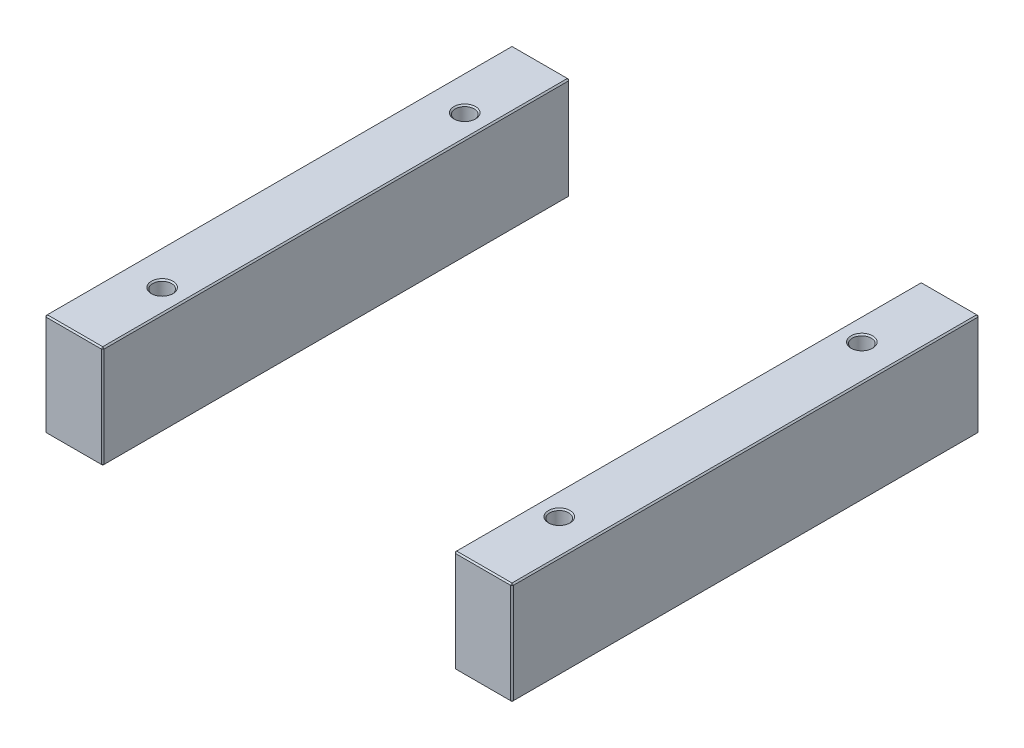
ISO-10303-21;
HEADER;
FILE_DESCRIPTION(('STEP AP214'),'2;1');
FILE_NAME('part.step','',(''),(''),'','','');
FILE_SCHEMA(('AUTOMOTIVE_DESIGN { 1 0 10303 214 1 1 1 1 }'));
ENDSEC;
DATA;
#1=APPLICATION_CONTEXT('core data for automotive mechanical design processes');
#2=APPLICATION_PROTOCOL_DEFINITION('international standard','automotive_design',2000,#1);
#3=PRODUCT_CONTEXT('',#1,'mechanical');
#4=PRODUCT('Part','Part','',(#3));
#5=PRODUCT_RELATED_PRODUCT_CATEGORY('part','',(#4));
#6=PRODUCT_DEFINITION_FORMATION('','',#4);
#7=PRODUCT_DEFINITION_CONTEXT('part definition',#1,'design');
#8=PRODUCT_DEFINITION('design','',#6,#7);
#9=PRODUCT_DEFINITION_SHAPE('','',#8);
#10=(LENGTH_UNIT() NAMED_UNIT(*) SI_UNIT(.MILLI.,.METRE.));
#11=(NAMED_UNIT(*) PLANE_ANGLE_UNIT() SI_UNIT($,.RADIAN.));
#12=(NAMED_UNIT(*) SI_UNIT($,.STERADIAN.) SOLID_ANGLE_UNIT());
#13=UNCERTAINTY_MEASURE_WITH_UNIT(LENGTH_MEASURE(1.E-05),#10,'distance_accuracy_value','');
#14=(GEOMETRIC_REPRESENTATION_CONTEXT(3) GLOBAL_UNCERTAINTY_ASSIGNED_CONTEXT((#13)) GLOBAL_UNIT_ASSIGNED_CONTEXT((#10,
#11,#12)) REPRESENTATION_CONTEXT('',''));
#15=CARTESIAN_POINT('',(0.,0.,0.));
#16=DIRECTION('',(0.,0.,1.));
#17=DIRECTION('',(1.,0.,0.));
#18=AXIS2_PLACEMENT_3D('',#15,#16,#17);
#19=CARTESIAN_POINT('',(-173.,76.,-173.));
#20=DIRECTION('',(0.,0.,1.));
#21=DIRECTION('',(1.,0.,0.));
#22=AXIS2_PLACEMENT_3D('',#19,#20,#21);
#23=PLANE('',#22);
#24=DIRECTION('',(-1.,0.,0.));
#25=VECTOR('',#24,1.);
#26=CARTESIAN_POINT('',(-173.,1.00000000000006,-173.));
#27=LINE('',#26,#25);
#28=CARTESIAN_POINT('',(-131.,1.00000000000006,-173.));
#29=VERTEX_POINT('',#28);
#30=CARTESIAN_POINT('',(-172.,1.00000000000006,-173.));
#31=VERTEX_POINT('',#30);
#32=EDGE_CURVE('P0_E137',#29,#31,#27,.T.);
#33=ORIENTED_EDGE('',*,*,#32,.T.);
#34=DIRECTION('',(0.,1.,0.));
#35=VECTOR('',#34,1.);
#36=CARTESIAN_POINT('',(-172.,76.,-173.));
#37=LINE('',#36,#35);
#38=CARTESIAN_POINT('',(-172.,75.,-173.));
#39=VERTEX_POINT('',#38);
#40=EDGE_CURVE('P0_E235',#31,#39,#37,.T.);
#41=ORIENTED_EDGE('',*,*,#40,.T.);
#42=DIRECTION('',(1.,0.,0.));
#43=VECTOR('',#42,1.);
#44=CARTESIAN_POINT('',(-173.,75.,-173.));
#45=LINE('',#44,#43);
#46=CARTESIAN_POINT('',(-131.,75.,-173.));
#47=VERTEX_POINT('',#46);
#48=EDGE_CURVE('P0_E233',#39,#47,#45,.T.);
#49=ORIENTED_EDGE('',*,*,#48,.T.);
#50=DIRECTION('',(0.,-1.,0.));
#51=VECTOR('',#50,1.);
#52=CARTESIAN_POINT('',(-131.,76.,-173.));
#53=LINE('',#52,#51);
#54=EDGE_CURVE('P0_E230',#47,#29,#53,.T.);
#55=ORIENTED_EDGE('',*,*,#54,.T.);
#56=EDGE_LOOP('',(#33,#41,#49,#55));
#57=FACE_BOUND('',#56,.T.);
#58=ADVANCED_FACE('P0_F16',(#57),#23,.F.);
#59=CARTESIAN_POINT('',(-173.,76.,173.));
#60=DIRECTION('',(1.,0.,0.));
#61=DIRECTION('',(0.,0.,-1.));
#62=AXIS2_PLACEMENT_3D('',#59,#60,#61);
#63=PLANE('',#62);
#64=DIRECTION('',(0.,1.,0.));
#65=VECTOR('',#64,1.);
#66=CARTESIAN_POINT('',(-173.,76.,172.));
#67=LINE('',#66,#65);
#68=CARTESIAN_POINT('',(-173.,1.00000000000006,172.));
#69=VERTEX_POINT('',#68);
#70=CARTESIAN_POINT('',(-173.,75.,172.));
#71=VERTEX_POINT('',#70);
#72=EDGE_CURVE('P0_E217',#69,#71,#67,.T.);
#73=ORIENTED_EDGE('',*,*,#72,.T.);
#74=DIRECTION('',(0.,0.,-1.));
#75=VECTOR('',#74,1.);
#76=CARTESIAN_POINT('',(-173.,75.,173.));
#77=LINE('',#76,#75);
#78=CARTESIAN_POINT('',(-173.,75.,-172.));
#79=VERTEX_POINT('',#78);
#80=EDGE_CURVE('P0_E228',#71,#79,#77,.T.);
#81=ORIENTED_EDGE('',*,*,#80,.T.);
#82=DIRECTION('',(0.,-1.,0.));
#83=VECTOR('',#82,1.);
#84=CARTESIAN_POINT('',(-173.,76.,-172.));
#85=LINE('',#84,#83);
#86=CARTESIAN_POINT('',(-173.,1.00000000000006,-172.));
#87=VERTEX_POINT('',#86);
#88=EDGE_CURVE('P0_E225',#79,#87,#85,.T.);
#89=ORIENTED_EDGE('',*,*,#88,.T.);
#90=DIRECTION('',(0.,0.,1.));
#91=VECTOR('',#90,1.);
#92=CARTESIAN_POINT('',(-173.,1.00000000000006,173.));
#93=LINE('',#92,#91);
#94=EDGE_CURVE('P0_E214',#87,#69,#93,.T.);
#95=ORIENTED_EDGE('',*,*,#94,.T.);
#96=EDGE_LOOP('',(#73,#81,#89,#95));
#97=FACE_BOUND('',#96,.T.);
#98=ADVANCED_FACE('P0_F302',(#97),#63,.F.);
#99=CARTESIAN_POINT('',(-173.,76.,173.));
#100=DIRECTION('',(0.,0.,-1.));
#101=DIRECTION('',(-1.,0.,0.));
#102=AXIS2_PLACEMENT_3D('',#99,#100,#101);
#103=PLANE('',#102);
#104=DIRECTION('',(-1.,0.,0.));
#105=VECTOR('',#104,1.);
#106=CARTESIAN_POINT('',(-173.,75.,173.));
#107=LINE('',#106,#105);
#108=CARTESIAN_POINT('',(-131.,75.,173.));
#109=VERTEX_POINT('',#108);
#110=CARTESIAN_POINT('',(-172.,75.,173.));
#111=VERTEX_POINT('',#110);
#112=EDGE_CURVE('P0_E242',#109,#111,#107,.T.);
#113=ORIENTED_EDGE('',*,*,#112,.T.);
#114=DIRECTION('',(0.,-1.,0.));
#115=VECTOR('',#114,1.);
#116=CARTESIAN_POINT('',(-172.,76.,173.));
#117=LINE('',#116,#115);
#118=CARTESIAN_POINT('',(-172.,1.00000000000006,173.));
#119=VERTEX_POINT('',#118);
#120=EDGE_CURVE('P0_E244',#111,#119,#117,.T.);
#121=ORIENTED_EDGE('',*,*,#120,.T.);
#122=DIRECTION('',(1.,0.,0.));
#123=VECTOR('',#122,1.);
#124=CARTESIAN_POINT('',(-130.,1.00000000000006,173.));
#125=LINE('',#124,#123);
#126=CARTESIAN_POINT('',(-131.,1.00000000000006,173.));
#127=VERTEX_POINT('',#126);
#128=EDGE_CURVE('P0_E240',#119,#127,#125,.T.);
#129=ORIENTED_EDGE('',*,*,#128,.T.);
#130=DIRECTION('',(0.,1.,0.));
#131=VECTOR('',#130,1.);
#132=CARTESIAN_POINT('',(-131.,76.,173.));
#133=LINE('',#132,#131);
#134=EDGE_CURVE('P0_E238',#127,#109,#133,.T.);
#135=ORIENTED_EDGE('',*,*,#134,.T.);
#136=EDGE_LOOP('',(#113,#121,#129,#135));
#137=FACE_BOUND('',#136,.T.);
#138=ADVANCED_FACE('P0_F341',(#137),#103,.F.);
#139=CARTESIAN_POINT('',(-130.,76.,-173.));
#140=DIRECTION('',(-1.,0.,0.));
#141=DIRECTION('',(0.,0.,1.));
#142=AXIS2_PLACEMENT_3D('',#139,#140,#141);
#143=PLANE('',#142);
#144=DIRECTION('',(0.,0.,1.));
#145=VECTOR('',#144,1.);
#146=CARTESIAN_POINT('',(-130.,75.,-173.));
#147=LINE('',#146,#145);
#148=CARTESIAN_POINT('',(-130.,75.,-172.));
#149=VERTEX_POINT('',#148);
#150=CARTESIAN_POINT('',(-130.,75.,172.));
#151=VERTEX_POINT('',#150);
#152=EDGE_CURVE('P0_E31',#149,#151,#147,.T.);
#153=ORIENTED_EDGE('',*,*,#152,.T.);
#154=DIRECTION('',(0.,-1.,0.));
#155=VECTOR('',#154,1.);
#156=CARTESIAN_POINT('',(-130.,76.,172.));
#157=LINE('',#156,#155);
#158=CARTESIAN_POINT('',(-130.,1.00000000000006,172.));
#159=VERTEX_POINT('',#158);
#160=EDGE_CURVE('P0_E190',#151,#159,#157,.T.);
#161=ORIENTED_EDGE('',*,*,#160,.T.);
#162=DIRECTION('',(0.,0.,-1.));
#163=VECTOR('',#162,1.);
#164=CARTESIAN_POINT('',(-130.,1.00000000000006,-173.));
#165=LINE('',#164,#163);
#166=CARTESIAN_POINT('',(-130.,1.00000000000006,-172.));
#167=VERTEX_POINT('',#166);
#168=EDGE_CURVE('P0_E256',#159,#167,#165,.T.);
#169=ORIENTED_EDGE('',*,*,#168,.T.);
#170=DIRECTION('',(0.,1.,0.));
#171=VECTOR('',#170,1.);
#172=CARTESIAN_POINT('',(-130.,76.,-172.));
#173=LINE('',#172,#171);
#174=EDGE_CURVE('P0_E36',#167,#149,#173,.T.);
#175=ORIENTED_EDGE('',*,*,#174,.T.);
#176=EDGE_LOOP('',(#153,#161,#169,#175));
#177=FACE_BOUND('',#176,.T.);
#178=ADVANCED_FACE('P0_F535',(#177),#143,.F.);
#179=CARTESIAN_POINT('',(0.,76.,0.));
#180=DIRECTION('',(0.,-1.,0.));
#181=DIRECTION('',(0.,0.,-1.));
#182=AXIS2_PLACEMENT_3D('',#179,#180,#181);
#183=PLANE('',#182);
#184=CARTESIAN_POINT('',(-147.,76.,112.));
#185=DIRECTION('',(0.,-1.,0.));
#186=DIRECTION('',(0.,0.,-1.));
#187=AXIS2_PLACEMENT_3D('',#184,#185,#186);
#188=CIRCLE('',#187,8.);
#189=CARTESIAN_POINT('',(-147.,76.,104.));
#190=VERTEX_POINT('',#189);
#191=EDGE_CURVE('P0_E24',#190,#190,#188,.T.);
#192=ORIENTED_EDGE('',*,*,#191,.T.);
#193=EDGE_LOOP('',(#192));
#194=FACE_BOUND('',#193,.T.);
#195=CARTESIAN_POINT('',(-147.,76.,-112.));
#196=DIRECTION('',(0.,-1.,0.));
#197=DIRECTION('',(0.,0.,-1.));
#198=AXIS2_PLACEMENT_3D('',#195,#196,#197);
#199=CIRCLE('',#198,8.);
#200=CARTESIAN_POINT('',(-147.,76.,-120.));
#201=VERTEX_POINT('',#200);
#202=EDGE_CURVE('P0_E189',#201,#201,#199,.T.);
#203=ORIENTED_EDGE('',*,*,#202,.T.);
#204=EDGE_LOOP('',(#203));
#205=FACE_BOUND('',#204,.T.);
#206=DIRECTION('',(0.,0.,1.));
#207=VECTOR('',#206,1.);
#208=CARTESIAN_POINT('',(-172.,76.,0.));
#209=LINE('',#208,#207);
#210=CARTESIAN_POINT('',(-172.,76.,-172.));
#211=VERTEX_POINT('',#210);
#212=CARTESIAN_POINT('',(-172.,76.,172.));
#213=VERTEX_POINT('',#212);
#214=EDGE_CURVE('P0_E251',#211,#213,#209,.T.);
#215=ORIENTED_EDGE('',*,*,#214,.T.);
#216=DIRECTION('',(1.,0.,0.));
#217=VECTOR('',#216,1.);
#218=CARTESIAN_POINT('',(1.11022302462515E-13,76.,172.));
#219=LINE('',#218,#217);
#220=CARTESIAN_POINT('',(-131.,76.,172.));
#221=VERTEX_POINT('',#220);
#222=EDGE_CURVE('P0_E253',#213,#221,#219,.T.);
#223=ORIENTED_EDGE('',*,*,#222,.T.);
#224=DIRECTION('',(0.,0.,-1.));
#225=VECTOR('',#224,1.);
#226=CARTESIAN_POINT('',(-131.,76.,0.));
#227=LINE('',#226,#225);
#228=CARTESIAN_POINT('',(-131.,76.,-172.));
#229=VERTEX_POINT('',#228);
#230=EDGE_CURVE('P0_E247',#221,#229,#227,.T.);
#231=ORIENTED_EDGE('',*,*,#230,.T.);
#232=DIRECTION('',(-1.,0.,0.));
#233=VECTOR('',#232,1.);
#234=CARTESIAN_POINT('',(-1.11022302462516E-13,76.,-172.));
#235=LINE('',#234,#233);
#236=EDGE_CURVE('P0_E249',#229,#211,#235,.T.);
#237=ORIENTED_EDGE('',*,*,#236,.T.);
#238=EDGE_LOOP('',(#215,#223,#231,#237));
#239=FACE_BOUND('',#238,.T.);
#240=ADVANCED_FACE('P0_F195',(#194,#205,#239),#183,.F.);
#241=CARTESIAN_POINT('',(0.,0.,0.));
#242=DIRECTION('',(0.,-1.,0.));
#243=DIRECTION('',(0.,0.,-1.));
#244=AXIS2_PLACEMENT_3D('',#241,#242,#243);
#245=PLANE('',#244);
#246=CARTESIAN_POINT('',(-147.,0.,-112.));
#247=DIRECTION('',(0.,-1.,0.));
#248=DIRECTION('',(0.,0.,-1.));
#249=AXIS2_PLACEMENT_3D('',#246,#247,#248);
#250=CIRCLE('',#249,8.);
#251=CARTESIAN_POINT('',(-147.,0.,-120.));
#252=VERTEX_POINT('',#251);
#253=EDGE_CURVE('P0_E220',#252,#252,#250,.F.);
#254=ORIENTED_EDGE('',*,*,#253,.T.);
#255=EDGE_LOOP('',(#254));
#256=FACE_BOUND('',#255,.T.);
#257=CARTESIAN_POINT('',(-147.,0.,112.));
#258=DIRECTION('',(0.,-1.,0.));
#259=DIRECTION('',(0.,0.,-1.));
#260=AXIS2_PLACEMENT_3D('',#257,#258,#259);
#261=CIRCLE('',#260,8.);
#262=CARTESIAN_POINT('',(-147.,0.,104.));
#263=VERTEX_POINT('',#262);
#264=EDGE_CURVE('P0_E608',#263,#263,#261,.F.);
#265=ORIENTED_EDGE('',*,*,#264,.T.);
#266=EDGE_LOOP('',(#265));
#267=FACE_BOUND('',#266,.T.);
#268=DIRECTION('',(-1.,0.,0.));
#269=VECTOR('',#268,1.);
#270=CARTESIAN_POINT('',(-173.,0.,172.));
#271=LINE('',#270,#269);
#272=CARTESIAN_POINT('',(-131.,0.,172.));
#273=VERTEX_POINT('',#272);
#274=CARTESIAN_POINT('',(-172.,0.,172.));
#275=VERTEX_POINT('',#274);
#276=EDGE_CURVE('P0_E114',#273,#275,#271,.T.);
#277=ORIENTED_EDGE('',*,*,#276,.T.);
#278=DIRECTION('',(0.,0.,-1.));
#279=VECTOR('',#278,1.);
#280=CARTESIAN_POINT('',(-172.,0.,-173.));
#281=LINE('',#280,#279);
#282=CARTESIAN_POINT('',(-172.,0.,-172.));
#283=VERTEX_POINT('',#282);
#284=EDGE_CURVE('P0_E110',#275,#283,#281,.T.);
#285=ORIENTED_EDGE('',*,*,#284,.T.);
#286=DIRECTION('',(1.,0.,0.));
#287=VECTOR('',#286,1.);
#288=CARTESIAN_POINT('',(-130.,0.,-172.));
#289=LINE('',#288,#287);
#290=CARTESIAN_POINT('',(-131.,0.,-172.));
#291=VERTEX_POINT('',#290);
#292=EDGE_CURVE('P0_E104',#283,#291,#289,.T.);
#293=ORIENTED_EDGE('',*,*,#292,.T.);
#294=DIRECTION('',(0.,0.,1.));
#295=VECTOR('',#294,1.);
#296=CARTESIAN_POINT('',(-131.,0.,173.));
#297=LINE('',#296,#295);
#298=EDGE_CURVE('P0_E107',#291,#273,#297,.T.);
#299=ORIENTED_EDGE('',*,*,#298,.T.);
#300=EDGE_LOOP('',(#277,#285,#293,#299));
#301=FACE_BOUND('',#300,.T.);
#302=ADVANCED_FACE('P0_F106',(#256,#267,#301),#245,.T.);
#303=CARTESIAN_POINT('',(-147.,0.,-112.));
#304=DIRECTION('',(0.,1.,0.));
#305=DIRECTION('',(0.,0.,1.));
#306=AXIS2_PLACEMENT_3D('',#303,#304,#305);
#307=CYLINDRICAL_SURFACE('',#306,7.);
#308=CARTESIAN_POINT('',(-147.,75.,-112.));
#309=DIRECTION('',(0.,-1.,0.));
#310=DIRECTION('',(0.,0.,-1.));
#311=AXIS2_PLACEMENT_3D('',#308,#309,#310);
#312=CIRCLE('',#311,7.);
#313=CARTESIAN_POINT('',(-147.,75.,-119.));
#314=VERTEX_POINT('',#313);
#315=EDGE_CURVE('P0_E10',#314,#314,#312,.F.);
#316=ORIENTED_EDGE('',*,*,#315,.T.);
#317=EDGE_LOOP('',(#316));
#318=FACE_BOUND('',#317,.T.);
#319=CARTESIAN_POINT('',(-147.,0.99999999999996,-112.));
#320=DIRECTION('',(0.,-1.,0.));
#321=DIRECTION('',(0.,0.,-1.));
#322=AXIS2_PLACEMENT_3D('',#319,#320,#321);
#323=CIRCLE('',#322,7.);
#324=CARTESIAN_POINT('',(-147.,0.99999999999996,-119.));
#325=VERTEX_POINT('',#324);
#326=EDGE_CURVE('P0_E215',#325,#325,#323,.T.);
#327=ORIENTED_EDGE('',*,*,#326,.T.);
#328=EDGE_LOOP('',(#327));
#329=FACE_BOUND('',#328,.T.);
#330=ADVANCED_FACE('P0_F208',(#318,#329),#307,.F.);
#331=CARTESIAN_POINT('',(-147.,0.,112.));
#332=DIRECTION('',(0.,1.,0.));
#333=DIRECTION('',(0.,0.,1.));
#334=AXIS2_PLACEMENT_3D('',#331,#332,#333);
#335=CYLINDRICAL_SURFACE('',#334,7.);
#336=CARTESIAN_POINT('',(-147.,75.,112.));
#337=DIRECTION('',(0.,-1.,0.));
#338=DIRECTION('',(0.,0.,-1.));
#339=AXIS2_PLACEMENT_3D('',#336,#337,#338);
#340=CIRCLE('',#339,7.);
#341=CARTESIAN_POINT('',(-147.,75.,105.));
#342=VERTEX_POINT('',#341);
#343=EDGE_CURVE('P0_E186',#342,#342,#340,.F.);
#344=ORIENTED_EDGE('',*,*,#343,.T.);
#345=EDGE_LOOP('',(#344));
#346=FACE_BOUND('',#345,.T.);
#347=CARTESIAN_POINT('',(-147.,0.99999999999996,112.));
#348=DIRECTION('',(0.,-1.,0.));
#349=DIRECTION('',(0.,0.,-1.));
#350=AXIS2_PLACEMENT_3D('',#347,#348,#349);
#351=CIRCLE('',#350,7.);
#352=CARTESIAN_POINT('',(-147.,0.99999999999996,105.));
#353=VERTEX_POINT('',#352);
#354=EDGE_CURVE('P0_E212',#353,#353,#351,.T.);
#355=ORIENTED_EDGE('',*,*,#354,.T.);
#356=EDGE_LOOP('',(#355));
#357=FACE_BOUND('',#356,.T.);
#358=ADVANCED_FACE('P0_F204',(#346,#357),#335,.F.);
#359=CARTESIAN_POINT('',(-147.,0.,-112.));
#360=DIRECTION('',(0.,-1.,0.));
#361=DIRECTION('',(0.,0.,-1.));
#362=AXIS2_PLACEMENT_3D('',#359,#360,#361);
#363=CONICAL_SURFACE('',#362,8.,0.78539816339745);
#364=ORIENTED_EDGE('',*,*,#326,.F.);
#365=EDGE_LOOP('',(#364));
#366=FACE_BOUND('',#365,.T.);
#367=ORIENTED_EDGE('',*,*,#253,.F.);
#368=EDGE_LOOP('',(#367));
#369=FACE_BOUND('',#368,.T.);
#370=ADVANCED_FACE('P0_F207',(#366,#369),#363,.F.);
#371=CARTESIAN_POINT('',(-147.,0.,112.));
#372=DIRECTION('',(0.,-1.,0.));
#373=DIRECTION('',(0.,0.,-1.));
#374=AXIS2_PLACEMENT_3D('',#371,#372,#373);
#375=CONICAL_SURFACE('',#374,8.,0.78539816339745);
#376=ORIENTED_EDGE('',*,*,#354,.F.);
#377=EDGE_LOOP('',(#376));
#378=FACE_BOUND('',#377,.T.);
#379=ORIENTED_EDGE('',*,*,#264,.F.);
#380=EDGE_LOOP('',(#379));
#381=FACE_BOUND('',#380,.T.);
#382=ADVANCED_FACE('P0_F347',(#378,#381),#375,.F.);
#383=CARTESIAN_POINT('',(-130.,76.,172.));
#384=DIRECTION('',(-0.707106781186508,0.,-0.707106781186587));
#385=DIRECTION('',(0.,-1.,0.));
#386=AXIS2_PLACEMENT_3D('',#383,#384,#385);
#387=PLANE('',#386);
#388=DIRECTION('',(-0.707106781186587,0.,0.707106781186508));
#389=VECTOR('',#388,1.);
#390=CARTESIAN_POINT('',(-130.5,75.,172.5));
#391=LINE('',#390,#389);
#392=EDGE_CURVE('P0_E125',#109,#151,#391,.F.);
#393=ORIENTED_EDGE('',*,*,#392,.F.);
#394=ORIENTED_EDGE('',*,*,#134,.F.);
#395=DIRECTION('',(0.707106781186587,0.,-0.707106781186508));
#396=VECTOR('',#395,1.);
#397=CARTESIAN_POINT('',(-131.,1.00000000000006,173.));
#398=LINE('',#397,#396);
#399=EDGE_CURVE('P0_E181',#159,#127,#398,.F.);
#400=ORIENTED_EDGE('',*,*,#399,.F.);
#401=ORIENTED_EDGE('',*,*,#160,.F.);
#402=EDGE_LOOP('',(#393,#394,#400,#401));
#403=FACE_BOUND('',#402,.T.);
#404=ADVANCED_FACE('P0_F351',(#403),#387,.F.);
#405=CARTESIAN_POINT('',(-131.,76.,172.));
#406=DIRECTION('',(0.577350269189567,0.577350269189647,0.577350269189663));
#407=DIRECTION('',(0.,-0.707106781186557,0.707106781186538));
#408=AXIS2_PLACEMENT_3D('',#405,#406,#407);
#409=PLANE('',#408);
#410=DIRECTION('',(0.,0.707106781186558,-0.707106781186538));
#411=VECTOR('',#410,1.);
#412=CARTESIAN_POINT('',(-131.,76.,172.));
#413=LINE('',#412,#411);
#414=EDGE_CURVE('P0_E175',#109,#221,#413,.T.);
#415=ORIENTED_EDGE('',*,*,#414,.F.);
#416=ORIENTED_EDGE('',*,*,#392,.T.);
#417=DIRECTION('',(0.707106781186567,-0.707106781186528,0.));
#418=VECTOR('',#417,1.);
#419=CARTESIAN_POINT('',(-131.,76.,172.));
#420=LINE('',#419,#418);
#421=EDGE_CURVE('P0_E178',#221,#151,#420,.T.);
#422=ORIENTED_EDGE('',*,*,#421,.F.);
#423=EDGE_LOOP('',(#415,#416,#422));
#424=FACE_BOUND('',#423,.T.);
#425=ADVANCED_FACE('P0_F487',(#424),#409,.T.);
#426=CARTESIAN_POINT('',(-131.,1.00000000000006,173.));
#427=DIRECTION('',(0.577350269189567,-0.577350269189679,0.577350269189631));
#428=DIRECTION('',(0.,-0.707106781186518,-0.707106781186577));
#429=AXIS2_PLACEMENT_3D('',#426,#427,#428);
#430=PLANE('',#429);
#431=DIRECTION('',(0.707106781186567,0.707106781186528,0.));
#432=VECTOR('',#431,1.);
#433=CARTESIAN_POINT('',(-130.5,0.50000000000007,172.));
#434=LINE('',#433,#432);
#435=EDGE_CURVE('P0_E123',#159,#273,#434,.F.);
#436=ORIENTED_EDGE('',*,*,#435,.F.);
#437=ORIENTED_EDGE('',*,*,#399,.T.);
#438=DIRECTION('',(0.,-0.707106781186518,-0.707106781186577));
#439=VECTOR('',#438,1.);
#440=CARTESIAN_POINT('',(-131.,1.00000000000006,173.));
#441=LINE('',#440,#439);
#442=EDGE_CURVE('P0_E172',#273,#127,#441,.F.);
#443=ORIENTED_EDGE('',*,*,#442,.F.);
#444=EDGE_LOOP('',(#436,#437,#443));
#445=FACE_BOUND('',#444,.T.);
#446=ADVANCED_FACE('P0_F478',(#445),#430,.T.);
#447=CARTESIAN_POINT('',(-131.,76.,0.));
#448=DIRECTION('',(-0.707106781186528,-0.707106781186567,0.));
#449=DIRECTION('',(0.,0.,-1.));
#450=AXIS2_PLACEMENT_3D('',#447,#448,#449);
#451=PLANE('',#450);
#452=ORIENTED_EDGE('',*,*,#421,.T.);
#453=ORIENTED_EDGE('',*,*,#152,.F.);
#454=DIRECTION('',(-0.707106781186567,0.707106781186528,0.));
#455=VECTOR('',#454,1.);
#456=CARTESIAN_POINT('',(-130.5,75.5,-172.));
#457=LINE('',#456,#455);
#458=EDGE_CURVE('P0_E165',#229,#149,#457,.F.);
#459=ORIENTED_EDGE('',*,*,#458,.F.);
#460=ORIENTED_EDGE('',*,*,#230,.F.);
#461=EDGE_LOOP('',(#452,#453,#459,#460));
#462=FACE_BOUND('',#461,.T.);
#463=ADVANCED_FACE('P0_F318',(#462),#451,.F.);
#464=CARTESIAN_POINT('',(1.11022302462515E-13,76.,172.));
#465=DIRECTION('',(0.,-0.707106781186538,-0.707106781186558));
#466=DIRECTION('',(1.,0.,0.));
#467=AXIS2_PLACEMENT_3D('',#464,#465,#466);
#468=PLANE('',#467);
#469=ORIENTED_EDGE('',*,*,#414,.T.);
#470=ORIENTED_EDGE('',*,*,#222,.F.);
#471=DIRECTION('',(0.,-0.707106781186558,0.707106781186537));
#472=VECTOR('',#471,1.);
#473=CARTESIAN_POINT('',(-172.,75.5,172.5));
#474=LINE('',#473,#472);
#475=EDGE_CURVE('P0_E162',#111,#213,#474,.F.);
#476=ORIENTED_EDGE('',*,*,#475,.F.);
#477=ORIENTED_EDGE('',*,*,#112,.F.);
#478=EDGE_LOOP('',(#469,#470,#476,#477));
#479=FACE_BOUND('',#478,.T.);
#480=ADVANCED_FACE('P0_F313',(#479),#468,.F.);
#481=CARTESIAN_POINT('',(-172.,76.,173.));
#482=DIRECTION('',(0.707106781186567,0.,-0.707106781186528));
#483=DIRECTION('',(0.,-1.,0.));
#484=AXIS2_PLACEMENT_3D('',#481,#482,#483);
#485=PLANE('',#484);
#486=DIRECTION('',(0.707106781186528,0.,0.707106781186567));
#487=VECTOR('',#486,1.);
#488=CARTESIAN_POINT('',(-172.,1.00000000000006,173.));
#489=LINE('',#488,#487);
#490=EDGE_CURVE('P0_E156',#119,#69,#489,.F.);
#491=ORIENTED_EDGE('',*,*,#490,.F.);
#492=ORIENTED_EDGE('',*,*,#120,.F.);
#493=DIRECTION('',(-0.707106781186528,0.,-0.707106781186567));
#494=VECTOR('',#493,1.);
#495=CARTESIAN_POINT('',(-173.,75.,172.));
#496=LINE('',#495,#494);
#497=EDGE_CURVE('P0_E159',#71,#111,#496,.F.);
#498=ORIENTED_EDGE('',*,*,#497,.F.);
#499=ORIENTED_EDGE('',*,*,#72,.F.);
#500=EDGE_LOOP('',(#491,#492,#498,#499));
#501=FACE_BOUND('',#500,.T.);
#502=ADVANCED_FACE('P0_F307',(#501),#485,.F.);
#503=CARTESIAN_POINT('',(-173.,1.00000000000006,173.));
#504=DIRECTION('',(0.,-0.707106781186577,0.707106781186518));
#505=DIRECTION('',(-1.,0.,0.));
#506=AXIS2_PLACEMENT_3D('',#503,#504,#505);
#507=PLANE('',#506);
#508=ORIENTED_EDGE('',*,*,#442,.T.);
#509=ORIENTED_EDGE('',*,*,#128,.F.);
#510=DIRECTION('',(0.,0.707106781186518,0.707106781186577));
#511=VECTOR('',#510,1.);
#512=CARTESIAN_POINT('',(-172.,1.00000000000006,173.));
#513=LINE('',#512,#511);
#514=EDGE_CURVE('P0_E134',#275,#119,#513,.T.);
#515=ORIENTED_EDGE('',*,*,#514,.F.);
#516=ORIENTED_EDGE('',*,*,#276,.F.);
#517=EDGE_LOOP('',(#508,#509,#515,#516));
#518=FACE_BOUND('',#517,.T.);
#519=ADVANCED_FACE('P0_F333',(#518),#507,.T.);
#520=CARTESIAN_POINT('',(-130.,1.00000000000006,-173.));
#521=DIRECTION('',(0.707106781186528,-0.707106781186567,0.));
#522=DIRECTION('',(0.,0.,1.));
#523=AXIS2_PLACEMENT_3D('',#520,#521,#522);
#524=PLANE('',#523);
#525=ORIENTED_EDGE('',*,*,#435,.T.);
#526=ORIENTED_EDGE('',*,*,#298,.F.);
#527=DIRECTION('',(-0.707106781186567,-0.707106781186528,0.));
#528=VECTOR('',#527,1.);
#529=CARTESIAN_POINT('',(-131.,0.,-172.));
#530=LINE('',#529,#528);
#531=EDGE_CURVE('P0_E120',#167,#291,#530,.T.);
#532=ORIENTED_EDGE('',*,*,#531,.F.);
#533=ORIENTED_EDGE('',*,*,#168,.F.);
#534=EDGE_LOOP('',(#525,#526,#532,#533));
#535=FACE_BOUND('',#534,.T.);
#536=ADVANCED_FACE('P0_F119',(#535),#524,.T.);
#537=CARTESIAN_POINT('',(-131.,76.,-173.));
#538=DIRECTION('',(-0.707106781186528,0.,0.707106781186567));
#539=DIRECTION('',(0.,-1.,0.));
#540=AXIS2_PLACEMENT_3D('',#537,#538,#539);
#541=PLANE('',#540);
#542=DIRECTION('',(0.707106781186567,0.,0.707106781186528));
#543=VECTOR('',#542,1.);
#544=CARTESIAN_POINT('',(-131.,75.,-173.));
#545=LINE('',#544,#543);
#546=EDGE_CURVE('P0_E168',#149,#47,#545,.F.);
#547=ORIENTED_EDGE('',*,*,#546,.F.);
#548=ORIENTED_EDGE('',*,*,#174,.F.);
#549=DIRECTION('',(-0.707106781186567,0.,-0.707106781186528));
#550=VECTOR('',#549,1.);
#551=CARTESIAN_POINT('',(-130.5,1.00000000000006,-172.5));
#552=LINE('',#551,#550);
#553=EDGE_CURVE('P0_E133',#29,#167,#552,.F.);
#554=ORIENTED_EDGE('',*,*,#553,.F.);
#555=ORIENTED_EDGE('',*,*,#54,.F.);
#556=EDGE_LOOP('',(#547,#548,#554,#555));
#557=FACE_BOUND('',#556,.T.);
#558=ADVANCED_FACE('P0_F323',(#557),#541,.F.);
#559=CARTESIAN_POINT('',(-131.,75.,-173.));
#560=DIRECTION('',(0.577350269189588,0.577350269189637,-0.577350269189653));
#561=DIRECTION('',(0.,0.707106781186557,0.707106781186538));
#562=AXIS2_PLACEMENT_3D('',#559,#560,#561);
#563=PLANE('',#562);
#564=ORIENTED_EDGE('',*,*,#458,.T.);
#565=ORIENTED_EDGE('',*,*,#546,.T.);
#566=DIRECTION('',(0.,-0.707106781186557,-0.707106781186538));
#567=VECTOR('',#566,1.);
#568=CARTESIAN_POINT('',(-131.,75.,-173.));
#569=LINE('',#568,#567);
#570=EDGE_CURVE('P0_E151',#229,#47,#569,.T.);
#571=ORIENTED_EDGE('',*,*,#570,.F.);
#572=EDGE_LOOP('',(#564,#565,#571));
#573=FACE_BOUND('',#572,.T.);
#574=ADVANCED_FACE('P0_F321',(#573),#563,.T.);
#575=CARTESIAN_POINT('',(-173.,75.,172.));
#576=DIRECTION('',(-0.577350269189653,0.577350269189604,0.57735026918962));
#577=DIRECTION('',(0.707106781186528,0.,0.707106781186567));
#578=AXIS2_PLACEMENT_3D('',#575,#576,#577);
#579=PLANE('',#578);
#580=ORIENTED_EDGE('',*,*,#497,.T.);
#581=ORIENTED_EDGE('',*,*,#475,.T.);
#582=DIRECTION('',(0.707106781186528,0.707106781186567,0.));
#583=VECTOR('',#582,1.);
#584=CARTESIAN_POINT('',(-173.,75.,172.));
#585=LINE('',#584,#583);
#586=EDGE_CURVE('P0_E142',#71,#213,#585,.T.);
#587=ORIENTED_EDGE('',*,*,#586,.F.);
#588=EDGE_LOOP('',(#580,#581,#587));
#589=FACE_BOUND('',#588,.T.);
#590=ADVANCED_FACE('P0_F310',(#589),#579,.T.);
#591=CARTESIAN_POINT('',(-172.,1.00000000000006,173.));
#592=DIRECTION('',(-0.57735026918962,-0.577350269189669,0.577350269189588));
#593=DIRECTION('',(0.707106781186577,-0.707106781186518,0.));
#594=AXIS2_PLACEMENT_3D('',#591,#592,#593);
#595=PLANE('',#594);
#596=ORIENTED_EDGE('',*,*,#514,.T.);
#597=ORIENTED_EDGE('',*,*,#490,.T.);
#598=DIRECTION('',(0.707106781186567,-0.707106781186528,0.));
#599=VECTOR('',#598,1.);
#600=CARTESIAN_POINT('',(-172.5,0.500000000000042,172.));
#601=LINE('',#600,#599);
#602=EDGE_CURVE('P0_E138',#275,#69,#601,.F.);
#603=ORIENTED_EDGE('',*,*,#602,.F.);
#604=EDGE_LOOP('',(#596,#597,#603));
#605=FACE_BOUND('',#604,.T.);
#606=ADVANCED_FACE('P0_F368',(#605),#595,.T.);
#607=CARTESIAN_POINT('',(-131.,0.,-172.));
#608=DIRECTION('',(0.577350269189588,-0.577350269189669,-0.57735026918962));
#609=DIRECTION('',(0.,0.707106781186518,-0.707106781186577));
#610=AXIS2_PLACEMENT_3D('',#607,#608,#609);
#611=PLANE('',#610);
#612=ORIENTED_EDGE('',*,*,#553,.T.);
#613=ORIENTED_EDGE('',*,*,#531,.T.);
#614=DIRECTION('',(0.,0.707106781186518,-0.707106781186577));
#615=VECTOR('',#614,1.);
#616=CARTESIAN_POINT('',(-131.,0.,-172.));
#617=LINE('',#616,#615);
#618=EDGE_CURVE('P0_E130',#29,#291,#617,.F.);
#619=ORIENTED_EDGE('',*,*,#618,.F.);
#620=EDGE_LOOP('',(#612,#613,#619));
#621=FACE_BOUND('',#620,.T.);
#622=ADVANCED_FACE('P0_F129',(#621),#611,.T.);
#623=CARTESIAN_POINT('',(-1.11022302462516E-13,76.,-172.));
#624=DIRECTION('',(0.,-0.707106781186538,0.707106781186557));
#625=DIRECTION('',(-1.,0.,0.));
#626=AXIS2_PLACEMENT_3D('',#623,#624,#625);
#627=PLANE('',#626);
#628=ORIENTED_EDGE('',*,*,#570,.T.);
#629=ORIENTED_EDGE('',*,*,#48,.F.);
#630=DIRECTION('',(0.,0.707106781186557,0.707106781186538));
#631=VECTOR('',#630,1.);
#632=CARTESIAN_POINT('',(-172.,75.,-173.));
#633=LINE('',#632,#631);
#634=EDGE_CURVE('P0_E139',#211,#39,#633,.F.);
#635=ORIENTED_EDGE('',*,*,#634,.F.);
#636=ORIENTED_EDGE('',*,*,#236,.F.);
#637=EDGE_LOOP('',(#628,#629,#635,#636));
#638=FACE_BOUND('',#637,.T.);
#639=ADVANCED_FACE('P0_F286',(#638),#627,.F.);
#640=CARTESIAN_POINT('',(-172.,76.,0.));
#641=DIRECTION('',(0.707106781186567,-0.707106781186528,0.));
#642=DIRECTION('',(0.,0.,1.));
#643=AXIS2_PLACEMENT_3D('',#640,#641,#642);
#644=PLANE('',#643);
#645=ORIENTED_EDGE('',*,*,#586,.T.);
#646=ORIENTED_EDGE('',*,*,#214,.F.);
#647=DIRECTION('',(-0.707106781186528,-0.707106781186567,0.));
#648=VECTOR('',#647,1.);
#649=CARTESIAN_POINT('',(-172.5,75.5,-172.));
#650=LINE('',#649,#648);
#651=EDGE_CURVE('P0_E145',#79,#211,#650,.F.);
#652=ORIENTED_EDGE('',*,*,#651,.F.);
#653=ORIENTED_EDGE('',*,*,#80,.F.);
#654=EDGE_LOOP('',(#645,#646,#652,#653));
#655=FACE_BOUND('',#654,.T.);
#656=ADVANCED_FACE('P0_F280',(#655),#644,.F.);
#657=CARTESIAN_POINT('',(-173.,1.00000000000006,173.));
#658=DIRECTION('',(-0.707106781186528,-0.707106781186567,0.));
#659=DIRECTION('',(0.,0.,-1.));
#660=AXIS2_PLACEMENT_3D('',#657,#658,#659);
#661=PLANE('',#660);
#662=ORIENTED_EDGE('',*,*,#602,.T.);
#663=ORIENTED_EDGE('',*,*,#94,.F.);
#664=DIRECTION('',(-0.707106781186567,0.707106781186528,0.));
#665=VECTOR('',#664,1.);
#666=CARTESIAN_POINT('',(-173.,1.00000000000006,-172.));
#667=LINE('',#666,#665);
#668=EDGE_CURVE('P0_E267',#283,#87,#667,.T.);
#669=ORIENTED_EDGE('',*,*,#668,.F.);
#670=ORIENTED_EDGE('',*,*,#284,.F.);
#671=EDGE_LOOP('',(#662,#663,#669,#670));
#672=FACE_BOUND('',#671,.T.);
#673=ADVANCED_FACE('P0_F298',(#672),#661,.T.);
#674=CARTESIAN_POINT('',(-173.,1.00000000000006,-173.));
#675=DIRECTION('',(0.,-0.707106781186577,-0.707106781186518));
#676=DIRECTION('',(1.,0.,0.));
#677=AXIS2_PLACEMENT_3D('',#674,#675,#676);
#678=PLANE('',#677);
#679=ORIENTED_EDGE('',*,*,#618,.T.);
#680=ORIENTED_EDGE('',*,*,#292,.F.);
#681=DIRECTION('',(0.,-0.707106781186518,0.707106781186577));
#682=VECTOR('',#681,1.);
#683=CARTESIAN_POINT('',(-172.,0.500000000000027,-172.5));
#684=LINE('',#683,#682);
#685=EDGE_CURVE('P0_E265',#31,#283,#684,.T.);
#686=ORIENTED_EDGE('',*,*,#685,.F.);
#687=ORIENTED_EDGE('',*,*,#32,.F.);
#688=EDGE_LOOP('',(#679,#680,#686,#687));
#689=FACE_BOUND('',#688,.T.);
#690=ADVANCED_FACE('P0_F136',(#689),#678,.T.);
#691=CARTESIAN_POINT('',(-172.,75.,-173.));
#692=DIRECTION('',(-0.577350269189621,0.577350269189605,-0.577350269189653));
#693=DIRECTION('',(-0.707106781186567,0.,0.707106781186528));
#694=AXIS2_PLACEMENT_3D('',#691,#692,#693);
#695=PLANE('',#694);
#696=ORIENTED_EDGE('',*,*,#651,.T.);
#697=ORIENTED_EDGE('',*,*,#634,.T.);
#698=DIRECTION('',(0.707106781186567,0.,-0.707106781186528));
#699=VECTOR('',#698,1.);
#700=CARTESIAN_POINT('',(-172.,75.,-173.));
#701=LINE('',#700,#699);
#702=EDGE_CURVE('P0_E263',#79,#39,#701,.T.);
#703=ORIENTED_EDGE('',*,*,#702,.F.);
#704=EDGE_LOOP('',(#696,#697,#703));
#705=FACE_BOUND('',#704,.T.);
#706=ADVANCED_FACE('P0_F273',(#705),#695,.T.);
#707=CARTESIAN_POINT('',(-173.,1.00000000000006,-172.));
#708=DIRECTION('',(-0.577350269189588,-0.577350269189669,-0.57735026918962));
#709=DIRECTION('',(0.,0.707106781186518,-0.707106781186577));
#710=AXIS2_PLACEMENT_3D('',#707,#708,#709);
#711=PLANE('',#710);
#712=ORIENTED_EDGE('',*,*,#685,.T.);
#713=ORIENTED_EDGE('',*,*,#668,.T.);
#714=DIRECTION('',(-0.707106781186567,0.,0.707106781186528));
#715=VECTOR('',#714,1.);
#716=CARTESIAN_POINT('',(-173.,1.00000000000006,-172.));
#717=LINE('',#716,#715);
#718=EDGE_CURVE('P0_E261',#31,#87,#717,.T.);
#719=ORIENTED_EDGE('',*,*,#718,.F.);
#720=EDGE_LOOP('',(#712,#713,#719));
#721=FACE_BOUND('',#720,.T.);
#722=ADVANCED_FACE('P0_F294',(#721),#711,.T.);
#723=CARTESIAN_POINT('',(-173.,76.,-172.));
#724=DIRECTION('',(0.707106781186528,0.,0.707106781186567));
#725=DIRECTION('',(0.,-1.,0.));
#726=AXIS2_PLACEMENT_3D('',#723,#724,#725);
#727=PLANE('',#726);
#728=ORIENTED_EDGE('',*,*,#702,.T.);
#729=ORIENTED_EDGE('',*,*,#40,.F.);
#730=ORIENTED_EDGE('',*,*,#718,.T.);
#731=ORIENTED_EDGE('',*,*,#88,.F.);
#732=EDGE_LOOP('',(#728,#729,#730,#731));
#733=FACE_BOUND('',#732,.T.);
#734=ADVANCED_FACE('P0_F201',(#733),#727,.F.);
#735=CARTESIAN_POINT('',(-147.,75.,112.));
#736=DIRECTION('',(0.,1.,0.));
#737=DIRECTION('',(0.,0.,1.));
#738=AXIS2_PLACEMENT_3D('',#735,#736,#737);
#739=CONICAL_SURFACE('',#738,7.,0.785398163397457);
#740=ORIENTED_EDGE('',*,*,#191,.F.);
#741=EDGE_LOOP('',(#740));
#742=FACE_BOUND('',#741,.T.);
#743=ORIENTED_EDGE('',*,*,#343,.F.);
#744=EDGE_LOOP('',(#743));
#745=FACE_BOUND('',#744,.T.);
#746=ADVANCED_FACE('P0_F198',(#742,#745),#739,.F.);
#747=CARTESIAN_POINT('',(-147.,75.,-112.));
#748=DIRECTION('',(0.,1.,0.));
#749=DIRECTION('',(0.,0.,1.));
#750=AXIS2_PLACEMENT_3D('',#747,#748,#749);
#751=CONICAL_SURFACE('',#750,7.,0.785398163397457);
#752=ORIENTED_EDGE('',*,*,#202,.F.);
#753=EDGE_LOOP('',(#752));
#754=FACE_BOUND('',#753,.T.);
#755=ORIENTED_EDGE('',*,*,#315,.F.);
#756=EDGE_LOOP('',(#755));
#757=FACE_BOUND('',#756,.T.);
#758=ADVANCED_FACE('P0_F18',(#754,#757),#751,.F.);
#759=CLOSED_SHELL('',(#58,#98,#138,#178,#240,#302,#330,#358,#370,#382,#404,#425,#446,#463,#480,
#502,#519,#536,#558,#574,#590,#606,#622,#639,#656,#673,#690,#706,#722,#734,#746,#758));
#760=MANIFOLD_SOLID_BREP('P0_B1',#759);
#761=CARTESIAN_POINT('',(173.,76.,173.));
#762=DIRECTION('',(0.,0.,-1.));
#763=DIRECTION('',(-1.,0.,0.));
#764=AXIS2_PLACEMENT_3D('',#761,#762,#763);
#765=PLANE('',#764);
#766=DIRECTION('',(0.,-1.,0.));
#767=VECTOR('',#766,1.);
#768=CARTESIAN_POINT('',(131.,76.,173.));
#769=LINE('',#768,#767);
#770=CARTESIAN_POINT('',(131.,75.,173.));
#771=VERTEX_POINT('',#770);
#772=CARTESIAN_POINT('',(131.,0.999999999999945,173.));
#773=VERTEX_POINT('',#772);
#774=EDGE_CURVE('P1_E174',#771,#773,#769,.T.);
#775=ORIENTED_EDGE('',*,*,#774,.T.);
#776=DIRECTION('',(1.,0.,0.));
#777=VECTOR('',#776,1.);
#778=CARTESIAN_POINT('',(173.,0.999999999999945,173.));
#779=LINE('',#778,#777);
#780=CARTESIAN_POINT('',(172.,0.999999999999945,173.));
#781=VERTEX_POINT('',#780);
#782=EDGE_CURVE('P1_E176',#773,#781,#779,.T.);
#783=ORIENTED_EDGE('',*,*,#782,.T.);
#784=DIRECTION('',(0.,1.,0.));
#785=VECTOR('',#784,1.);
#786=CARTESIAN_POINT('',(172.,76.,173.));
#787=LINE('',#786,#785);
#788=CARTESIAN_POINT('',(172.,75.,173.));
#789=VERTEX_POINT('',#788);
#790=EDGE_CURVE('P1_E172',#781,#789,#787,.T.);
#791=ORIENTED_EDGE('',*,*,#790,.T.);
#792=DIRECTION('',(-1.,0.,0.));
#793=VECTOR('',#792,1.);
#794=CARTESIAN_POINT('',(130.,75.,173.));
#795=LINE('',#794,#793);
#796=EDGE_CURVE('P1_E170',#789,#771,#795,.T.);
#797=ORIENTED_EDGE('',*,*,#796,.T.);
#798=EDGE_LOOP('',(#775,#783,#791,#797));
#799=FACE_BOUND('',#798,.T.);
#800=ADVANCED_FACE('P1_F17',(#799),#765,.F.);
#801=CARTESIAN_POINT('',(173.,76.,173.));
#802=DIRECTION('',(-1.,0.,0.));
#803=DIRECTION('',(0.,0.,1.));
#804=AXIS2_PLACEMENT_3D('',#801,#802,#803);
#805=PLANE('',#804);
#806=DIRECTION('',(0.,0.,1.));
#807=VECTOR('',#806,1.);
#808=CARTESIAN_POINT('',(173.,75.,173.));
#809=LINE('',#808,#807);
#810=CARTESIAN_POINT('',(173.,75.,-172.));
#811=VERTEX_POINT('',#810);
#812=CARTESIAN_POINT('',(173.,75.,172.));
#813=VERTEX_POINT('',#812);
#814=EDGE_CURVE('P1_E188',#811,#813,#809,.T.);
#815=ORIENTED_EDGE('',*,*,#814,.T.);
#816=DIRECTION('',(0.,-1.,0.));
#817=VECTOR('',#816,1.);
#818=CARTESIAN_POINT('',(173.,76.,172.));
#819=LINE('',#818,#817);
#820=CARTESIAN_POINT('',(173.,0.999999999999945,172.));
#821=VERTEX_POINT('',#820);
#822=EDGE_CURVE('P1_E194',#813,#821,#819,.T.);
#823=ORIENTED_EDGE('',*,*,#822,.T.);
#824=DIRECTION('',(0.,0.,-1.));
#825=VECTOR('',#824,1.);
#826=CARTESIAN_POINT('',(173.,0.999999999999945,173.));
#827=LINE('',#826,#825);
#828=CARTESIAN_POINT('',(173.,0.999999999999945,-172.));
#829=VERTEX_POINT('',#828);
#830=EDGE_CURVE('P1_E192',#821,#829,#827,.T.);
#831=ORIENTED_EDGE('',*,*,#830,.T.);
#832=DIRECTION('',(0.,1.,0.));
#833=VECTOR('',#832,1.);
#834=CARTESIAN_POINT('',(173.,76.,-172.));
#835=LINE('',#834,#833);
#836=EDGE_CURVE('P1_E190',#829,#811,#835,.T.);
#837=ORIENTED_EDGE('',*,*,#836,.T.);
#838=EDGE_LOOP('',(#815,#823,#831,#837));
#839=FACE_BOUND('',#838,.T.);
#840=ADVANCED_FACE('P1_F276',(#839),#805,.F.);
#841=CARTESIAN_POINT('',(173.,76.,-173.));
#842=DIRECTION('',(0.,0.,1.));
#843=DIRECTION('',(1.,0.,0.));
#844=AXIS2_PLACEMENT_3D('',#841,#842,#843);
#845=PLANE('',#844);
#846=DIRECTION('',(0.,-1.,0.));
#847=VECTOR('',#846,1.);
#848=CARTESIAN_POINT('',(172.,76.,-173.));
#849=LINE('',#848,#847);
#850=CARTESIAN_POINT('',(172.,75.,-173.));
#851=VERTEX_POINT('',#850);
#852=CARTESIAN_POINT('',(172.,0.999999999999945,-173.));
#853=VERTEX_POINT('',#852);
#854=EDGE_CURVE('P1_E165',#851,#853,#849,.T.);
#855=ORIENTED_EDGE('',*,*,#854,.T.);
#856=DIRECTION('',(-1.,0.,0.));
#857=VECTOR('',#856,1.);
#858=CARTESIAN_POINT('',(173.,0.999999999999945,-173.));
#859=LINE('',#858,#857);
#860=CARTESIAN_POINT('',(131.,0.999999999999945,-173.));
#861=VERTEX_POINT('',#860);
#862=EDGE_CURVE('P1_E113',#853,#861,#859,.T.);
#863=ORIENTED_EDGE('',*,*,#862,.T.);
#864=DIRECTION('',(0.,1.,0.));
#865=VECTOR('',#864,1.);
#866=CARTESIAN_POINT('',(131.,76.,-173.));
#867=LINE('',#866,#865);
#868=CARTESIAN_POINT('',(131.,75.,-173.));
#869=VERTEX_POINT('',#868);
#870=EDGE_CURVE('P1_E167',#861,#869,#867,.T.);
#871=ORIENTED_EDGE('',*,*,#870,.T.);
#872=DIRECTION('',(1.,0.,0.));
#873=VECTOR('',#872,1.);
#874=CARTESIAN_POINT('',(173.,75.,-173.));
#875=LINE('',#874,#873);
#876=EDGE_CURVE('P1_E163',#869,#851,#875,.T.);
#877=ORIENTED_EDGE('',*,*,#876,.T.);
#878=EDGE_LOOP('',(#855,#863,#871,#877));
#879=FACE_BOUND('',#878,.T.);
#880=ADVANCED_FACE('P1_F333',(#879),#845,.F.);
#881=CARTESIAN_POINT('',(130.,76.,-173.));
#882=DIRECTION('',(1.,0.,0.));
#883=DIRECTION('',(0.,0.,-1.));
#884=AXIS2_PLACEMENT_3D('',#881,#882,#883);
#885=PLANE('',#884);
#886=DIRECTION('',(0.,0.,-1.));
#887=VECTOR('',#886,1.);
#888=CARTESIAN_POINT('',(130.,75.,-173.));
#889=LINE('',#888,#887);
#890=CARTESIAN_POINT('',(130.,75.,172.));
#891=VERTEX_POINT('',#890);
#892=CARTESIAN_POINT('',(130.,75.,-172.));
#893=VERTEX_POINT('',#892);
#894=EDGE_CURVE('P1_E179',#891,#893,#889,.T.);
#895=ORIENTED_EDGE('',*,*,#894,.T.);
#896=DIRECTION('',(0.,-1.,0.));
#897=VECTOR('',#896,1.);
#898=CARTESIAN_POINT('',(130.,76.,-172.));
#899=LINE('',#898,#897);
#900=CARTESIAN_POINT('',(130.,0.999999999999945,-172.));
#901=VERTEX_POINT('',#900);
#902=EDGE_CURVE('P1_E185',#893,#901,#899,.T.);
#903=ORIENTED_EDGE('',*,*,#902,.T.);
#904=DIRECTION('',(0.,0.,1.));
#905=VECTOR('',#904,1.);
#906=CARTESIAN_POINT('',(130.,0.999999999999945,-173.));
#907=LINE('',#906,#905);
#908=CARTESIAN_POINT('',(130.,0.999999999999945,172.));
#909=VERTEX_POINT('',#908);
#910=EDGE_CURVE('P1_E183',#901,#909,#907,.T.);
#911=ORIENTED_EDGE('',*,*,#910,.T.);
#912=DIRECTION('',(0.,1.,0.));
#913=VECTOR('',#912,1.);
#914=CARTESIAN_POINT('',(130.,76.,172.));
#915=LINE('',#914,#913);
#916=EDGE_CURVE('P1_E181',#909,#891,#915,.T.);
#917=ORIENTED_EDGE('',*,*,#916,.T.);
#918=EDGE_LOOP('',(#895,#903,#911,#917));
#919=FACE_BOUND('',#918,.T.);
#920=ADVANCED_FACE('P1_F544',(#919),#885,.F.);
#921=CARTESIAN_POINT('',(0.,76.,0.));
#922=DIRECTION('',(0.,1.,0.));
#923=DIRECTION('',(0.,0.,1.));
#924=AXIS2_PLACEMENT_3D('',#921,#922,#923);
#925=PLANE('',#924);
#926=DIRECTION('',(-1.,0.,0.));
#927=VECTOR('',#926,1.);
#928=CARTESIAN_POINT('',(130.,76.,-172.));
#929=LINE('',#928,#927);
#930=CARTESIAN_POINT('',(172.,76.,-172.));
#931=VERTEX_POINT('',#930);
#932=CARTESIAN_POINT('',(131.,76.,-172.));
#933=VERTEX_POINT('',#932);
#934=EDGE_CURVE('P1_E26',#931,#933,#929,.T.);
#935=ORIENTED_EDGE('',*,*,#934,.T.);
#936=DIRECTION('',(0.,0.,1.));
#937=VECTOR('',#936,1.);
#938=CARTESIAN_POINT('',(131.,76.,173.));
#939=LINE('',#938,#937);
#940=CARTESIAN_POINT('',(131.,76.,172.));
#941=VERTEX_POINT('',#940);
#942=EDGE_CURVE('P1_E11',#933,#941,#939,.T.);
#943=ORIENTED_EDGE('',*,*,#942,.T.);
#944=DIRECTION('',(1.,0.,0.));
#945=VECTOR('',#944,1.);
#946=CARTESIAN_POINT('',(173.,76.,172.));
#947=LINE('',#946,#945);
#948=CARTESIAN_POINT('',(172.,76.,172.));
#949=VERTEX_POINT('',#948);
#950=EDGE_CURVE('P1_E203',#941,#949,#947,.T.);
#951=ORIENTED_EDGE('',*,*,#950,.T.);
#952=DIRECTION('',(0.,0.,-1.));
#953=VECTOR('',#952,1.);
#954=CARTESIAN_POINT('',(172.,76.,-173.));
#955=LINE('',#954,#953);
#956=EDGE_CURVE('P1_E37',#949,#931,#955,.T.);
#957=ORIENTED_EDGE('',*,*,#956,.T.);
#958=EDGE_LOOP('',(#935,#943,#951,#957));
#959=FACE_BOUND('',#958,.T.);
#960=CARTESIAN_POINT('',(147.,76.,-112.));
#961=DIRECTION('',(0.,1.,0.));
#962=DIRECTION('',(0.,0.,1.));
#963=AXIS2_PLACEMENT_3D('',#960,#961,#962);
#964=CIRCLE('',#963,8.00000000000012);
#965=CARTESIAN_POINT('',(147.,76.,-104.));
#966=VERTEX_POINT('',#965);
#967=EDGE_CURVE('P1_E200',#966,#966,#964,.F.);
#968=ORIENTED_EDGE('',*,*,#967,.T.);
#969=EDGE_LOOP('',(#968));
#970=FACE_BOUND('',#969,.T.);
#971=CARTESIAN_POINT('',(147.,76.,112.));
#972=DIRECTION('',(0.,1.,0.));
#973=DIRECTION('',(0.,0.,1.));
#974=AXIS2_PLACEMENT_3D('',#971,#972,#973);
#975=CIRCLE('',#974,8.);
#976=CARTESIAN_POINT('',(147.,76.,120.));
#977=VERTEX_POINT('',#976);
#978=EDGE_CURVE('P1_E197',#977,#977,#975,.F.);
#979=ORIENTED_EDGE('',*,*,#978,.T.);
#980=EDGE_LOOP('',(#979));
#981=FACE_BOUND('',#980,.T.);
#982=ADVANCED_FACE('P1_F299',(#959,#970,#981),#925,.T.);
#983=CARTESIAN_POINT('',(0.,0.,0.));
#984=DIRECTION('',(0.,1.,0.));
#985=DIRECTION('',(0.,0.,1.));
#986=AXIS2_PLACEMENT_3D('',#983,#984,#985);
#987=PLANE('',#986);
#988=CARTESIAN_POINT('',(147.,0.,-112.));
#989=DIRECTION('',(0.,1.,0.));
#990=DIRECTION('',(0.,0.,1.));
#991=AXIS2_PLACEMENT_3D('',#988,#989,#990);
#992=CIRCLE('',#991,8.);
#993=CARTESIAN_POINT('',(147.,0.,-104.));
#994=VERTEX_POINT('',#993);
#995=EDGE_CURVE('P1_E148',#994,#994,#992,.T.);
#996=ORIENTED_EDGE('',*,*,#995,.T.);
#997=EDGE_LOOP('',(#996));
#998=FACE_BOUND('',#997,.T.);
#999=CARTESIAN_POINT('',(147.,0.,112.));
#1000=DIRECTION('',(0.,1.,0.));
#1001=DIRECTION('',(0.,0.,1.));
#1002=AXIS2_PLACEMENT_3D('',#999,#1000,#1001);
#1003=CIRCLE('',#1002,8.);
#1004=CARTESIAN_POINT('',(147.,0.,120.));
#1005=VERTEX_POINT('',#1004);
#1006=EDGE_CURVE('P1_E142',#1005,#1005,#1003,.T.);
#1007=ORIENTED_EDGE('',*,*,#1006,.T.);
#1008=EDGE_LOOP('',(#1007));
#1009=FACE_BOUND('',#1008,.T.);
#1010=DIRECTION('',(-1.,0.,0.));
#1011=VECTOR('',#1010,1.);
#1012=CARTESIAN_POINT('',(0.,0.,172.));
#1013=LINE('',#1012,#1011);
#1014=CARTESIAN_POINT('',(172.,0.,172.));
#1015=VERTEX_POINT('',#1014);
#1016=CARTESIAN_POINT('',(131.,0.,172.));
#1017=VERTEX_POINT('',#1016);
#1018=EDGE_CURVE('P1_E135',#1015,#1017,#1013,.T.);
#1019=ORIENTED_EDGE('',*,*,#1018,.T.);
#1020=DIRECTION('',(0.,0.,-1.));
#1021=VECTOR('',#1020,1.);
#1022=CARTESIAN_POINT('',(131.,0.,0.));
#1023=LINE('',#1022,#1021);
#1024=CARTESIAN_POINT('',(131.,0.,-172.));
#1025=VERTEX_POINT('',#1024);
#1026=EDGE_CURVE('P1_E139',#1017,#1025,#1023,.T.);
#1027=ORIENTED_EDGE('',*,*,#1026,.T.);
#1028=DIRECTION('',(1.,0.,0.));
#1029=VECTOR('',#1028,1.);
#1030=CARTESIAN_POINT('',(-1.11022302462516E-13,0.,-172.));
#1031=LINE('',#1030,#1029);
#1032=CARTESIAN_POINT('',(172.,0.,-172.));
#1033=VERTEX_POINT('',#1032);
#1034=EDGE_CURVE('P1_E110',#1025,#1033,#1031,.T.);
#1035=ORIENTED_EDGE('',*,*,#1034,.T.);
#1036=DIRECTION('',(0.,0.,1.));
#1037=VECTOR('',#1036,1.);
#1038=CARTESIAN_POINT('',(172.,0.,0.));
#1039=LINE('',#1038,#1037);
#1040=EDGE_CURVE('P1_E129',#1033,#1015,#1039,.T.);
#1041=ORIENTED_EDGE('',*,*,#1040,.T.);
#1042=EDGE_LOOP('',(#1019,#1027,#1035,#1041));
#1043=FACE_BOUND('',#1042,.T.);
#1044=ADVANCED_FACE('P1_F137',(#998,#1009,#1043),#987,.F.);
#1045=CARTESIAN_POINT('',(147.,0.,-112.));
#1046=DIRECTION('',(0.,1.,0.));
#1047=DIRECTION('',(0.,0.,1.));
#1048=AXIS2_PLACEMENT_3D('',#1045,#1046,#1047);
#1049=CYLINDRICAL_SURFACE('',#1048,7.);
#1050=CARTESIAN_POINT('',(147.,0.999999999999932,-112.));
#1051=DIRECTION('',(0.,1.,0.));
#1052=DIRECTION('',(0.,0.,1.));
#1053=AXIS2_PLACEMENT_3D('',#1050,#1051,#1052);
#1054=CIRCLE('',#1053,7.);
#1055=CARTESIAN_POINT('',(147.,0.999999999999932,-105.));
#1056=VERTEX_POINT('',#1055);
#1057=EDGE_CURVE('P1_E154',#1056,#1056,#1054,.F.);
#1058=ORIENTED_EDGE('',*,*,#1057,.T.);
#1059=EDGE_LOOP('',(#1058));
#1060=FACE_BOUND('',#1059,.T.);
#1061=CARTESIAN_POINT('',(147.,75.,-112.));
#1062=DIRECTION('',(0.,1.,0.));
#1063=DIRECTION('',(0.,0.,1.));
#1064=AXIS2_PLACEMENT_3D('',#1061,#1062,#1063);
#1065=CIRCLE('',#1064,7.);
#1066=CARTESIAN_POINT('',(147.,75.,-105.));
#1067=VERTEX_POINT('',#1066);
#1068=EDGE_CURVE('P1_E151',#1067,#1067,#1065,.T.);
#1069=ORIENTED_EDGE('',*,*,#1068,.T.);
#1070=EDGE_LOOP('',(#1069));
#1071=FACE_BOUND('',#1070,.T.);
#1072=ADVANCED_FACE('P1_F515',(#1060,#1071),#1049,.F.);
#1073=CARTESIAN_POINT('',(147.,0.,112.));
#1074=DIRECTION('',(0.,1.,0.));
#1075=DIRECTION('',(0.,0.,1.));
#1076=AXIS2_PLACEMENT_3D('',#1073,#1074,#1075);
#1077=CYLINDRICAL_SURFACE('',#1076,7.);
#1078=CARTESIAN_POINT('',(147.,0.999999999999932,112.));
#1079=DIRECTION('',(0.,1.,0.));
#1080=DIRECTION('',(0.,0.,1.));
#1081=AXIS2_PLACEMENT_3D('',#1078,#1079,#1080);
#1082=CIRCLE('',#1081,7.);
#1083=CARTESIAN_POINT('',(147.,0.999999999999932,119.));
#1084=VERTEX_POINT('',#1083);
#1085=EDGE_CURVE('P1_E160',#1084,#1084,#1082,.F.);
#1086=ORIENTED_EDGE('',*,*,#1085,.T.);
#1087=EDGE_LOOP('',(#1086));
#1088=FACE_BOUND('',#1087,.T.);
#1089=CARTESIAN_POINT('',(147.,75.,112.));
#1090=DIRECTION('',(0.,1.,0.));
#1091=DIRECTION('',(0.,0.,1.));
#1092=AXIS2_PLACEMENT_3D('',#1089,#1090,#1091);
#1093=CIRCLE('',#1092,7.);
#1094=CARTESIAN_POINT('',(147.,75.,119.));
#1095=VERTEX_POINT('',#1094);
#1096=EDGE_CURVE('P1_E157',#1095,#1095,#1093,.T.);
#1097=ORIENTED_EDGE('',*,*,#1096,.T.);
#1098=EDGE_LOOP('',(#1097));
#1099=FACE_BOUND('',#1098,.T.);
#1100=ADVANCED_FACE('P1_F341',(#1088,#1099),#1077,.F.);
#1101=CARTESIAN_POINT('',(147.,0.,-112.));
#1102=DIRECTION('',(0.,-1.,0.));
#1103=DIRECTION('',(0.,0.,-1.));
#1104=AXIS2_PLACEMENT_3D('',#1101,#1102,#1103);
#1105=CONICAL_SURFACE('',#1104,8.,0.78539816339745);
#1106=ORIENTED_EDGE('',*,*,#1057,.F.);
#1107=EDGE_LOOP('',(#1106));
#1108=FACE_BOUND('',#1107,.T.);
#1109=ORIENTED_EDGE('',*,*,#995,.F.);
#1110=EDGE_LOOP('',(#1109));
#1111=FACE_BOUND('',#1110,.T.);
#1112=ADVANCED_FACE('P1_F337',(#1108,#1111),#1105,.F.);
#1113=CARTESIAN_POINT('',(147.,0.,112.));
#1114=DIRECTION('',(0.,-1.,0.));
#1115=DIRECTION('',(0.,0.,-1.));
#1116=AXIS2_PLACEMENT_3D('',#1113,#1114,#1115);
#1117=CONICAL_SURFACE('',#1116,8.,0.78539816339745);
#1118=ORIENTED_EDGE('',*,*,#1085,.F.);
#1119=EDGE_LOOP('',(#1118));
#1120=FACE_BOUND('',#1119,.T.);
#1121=ORIENTED_EDGE('',*,*,#1006,.F.);
#1122=EDGE_LOOP('',(#1121));
#1123=FACE_BOUND('',#1122,.T.);
#1124=ADVANCED_FACE('P1_F340',(#1120,#1123),#1117,.F.);
#1125=CARTESIAN_POINT('',(0.,76.,172.));
#1126=DIRECTION('',(0.,0.707106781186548,0.707106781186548));
#1127=DIRECTION('',(-1.,0.,0.));
#1128=AXIS2_PLACEMENT_3D('',#1125,#1126,#1127);
#1129=PLANE('',#1128);
#1130=DIRECTION('',(0.,-0.707106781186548,0.707106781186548));
#1131=VECTOR('',#1130,1.);
#1132=CARTESIAN_POINT('',(172.,75.,173.));
#1133=LINE('',#1132,#1131);
#1134=EDGE_CURVE('P1_E21',#949,#789,#1133,.T.);
#1135=ORIENTED_EDGE('',*,*,#1134,.F.);
#1136=ORIENTED_EDGE('',*,*,#950,.F.);
#1137=DIRECTION('',(0.,0.707106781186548,-0.707106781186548));
#1138=VECTOR('',#1137,1.);
#1139=CARTESIAN_POINT('',(131.,75.5,172.5));
#1140=LINE('',#1139,#1138);
#1141=EDGE_CURVE('P1_E255',#771,#941,#1140,.T.);
#1142=ORIENTED_EDGE('',*,*,#1141,.F.);
#1143=ORIENTED_EDGE('',*,*,#796,.F.);
#1144=EDGE_LOOP('',(#1135,#1136,#1142,#1143));
#1145=FACE_BOUND('',#1144,.T.);
#1146=ADVANCED_FACE('P1_F301',(#1145),#1129,.T.);
#1147=CARTESIAN_POINT('',(172.,75.,173.));
#1148=DIRECTION('',(0.577350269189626,0.577350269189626,0.577350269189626));
#1149=DIRECTION('',(0.707106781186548,0.,-0.707106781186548));
#1150=AXIS2_PLACEMENT_3D('',#1147,#1148,#1149);
#1151=PLANE('',#1150);
#1152=DIRECTION('',(-0.707106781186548,0.707106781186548,0.));
#1153=VECTOR('',#1152,1.);
#1154=CARTESIAN_POINT('',(172.5,75.5,172.));
#1155=LINE('',#1154,#1153);
#1156=EDGE_CURVE('P1_E250',#949,#813,#1155,.F.);
#1157=ORIENTED_EDGE('',*,*,#1156,.F.);
#1158=ORIENTED_EDGE('',*,*,#1134,.T.);
#1159=DIRECTION('',(-0.707106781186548,0.,0.707106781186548));
#1160=VECTOR('',#1159,1.);
#1161=CARTESIAN_POINT('',(172.,75.,173.));
#1162=LINE('',#1161,#1160);
#1163=EDGE_CURVE('P1_E253',#813,#789,#1162,.T.);
#1164=ORIENTED_EDGE('',*,*,#1163,.F.);
#1165=EDGE_LOOP('',(#1157,#1158,#1164));
#1166=FACE_BOUND('',#1165,.T.);
#1167=ADVANCED_FACE('P1_F267',(#1166),#1151,.T.);
#1168=CARTESIAN_POINT('',(130.,75.,172.));
#1169=DIRECTION('',(-0.577350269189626,0.577350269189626,0.577350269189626));
#1170=DIRECTION('',(0.707106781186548,0.,0.707106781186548));
#1171=AXIS2_PLACEMENT_3D('',#1168,#1169,#1170);
#1172=PLANE('',#1171);
#1173=DIRECTION('',(-0.707106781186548,0.,-0.707106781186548));
#1174=VECTOR('',#1173,1.);
#1175=CARTESIAN_POINT('',(130.,75.,172.));
#1176=LINE('',#1175,#1174);
#1177=EDGE_CURVE('P1_E245',#771,#891,#1176,.T.);
#1178=ORIENTED_EDGE('',*,*,#1177,.F.);
#1179=ORIENTED_EDGE('',*,*,#1141,.T.);
#1180=DIRECTION('',(-0.707106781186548,-0.707106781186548,0.));
#1181=VECTOR('',#1180,1.);
#1182=CARTESIAN_POINT('',(130.,75.,172.));
#1183=LINE('',#1182,#1181);
#1184=EDGE_CURVE('P1_E248',#891,#941,#1183,.F.);
#1185=ORIENTED_EDGE('',*,*,#1184,.F.);
#1186=EDGE_LOOP('',(#1178,#1179,#1185));
#1187=FACE_BOUND('',#1186,.T.);
#1188=ADVANCED_FACE('P1_F303',(#1187),#1172,.T.);
#1189=CARTESIAN_POINT('',(173.,76.,172.));
#1190=DIRECTION('',(-0.707106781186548,0.,-0.707106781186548));
#1191=DIRECTION('',(0.,-1.,0.));
#1192=AXIS2_PLACEMENT_3D('',#1189,#1190,#1191);
#1193=PLANE('',#1192);
#1194=ORIENTED_EDGE('',*,*,#1163,.T.);
#1195=ORIENTED_EDGE('',*,*,#790,.F.);
#1196=DIRECTION('',(0.707106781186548,0.,-0.707106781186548));
#1197=VECTOR('',#1196,1.);
#1198=CARTESIAN_POINT('',(172.,0.999999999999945,173.));
#1199=LINE('',#1198,#1197);
#1200=EDGE_CURVE('P1_E240',#821,#781,#1199,.F.);
#1201=ORIENTED_EDGE('',*,*,#1200,.F.);
#1202=ORIENTED_EDGE('',*,*,#822,.F.);
#1203=EDGE_LOOP('',(#1194,#1195,#1201,#1202));
#1204=FACE_BOUND('',#1203,.T.);
#1205=ADVANCED_FACE('P1_F273',(#1204),#1193,.F.);
#1206=CARTESIAN_POINT('',(172.,76.,0.));
#1207=DIRECTION('',(0.707106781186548,0.707106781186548,0.));
#1208=DIRECTION('',(0.,0.,1.));
#1209=AXIS2_PLACEMENT_3D('',#1206,#1207,#1208);
#1210=PLANE('',#1209);
#1211=ORIENTED_EDGE('',*,*,#1156,.T.);
#1212=ORIENTED_EDGE('',*,*,#814,.F.);
#1213=DIRECTION('',(0.707106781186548,-0.707106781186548,0.));
#1214=VECTOR('',#1213,1.);
#1215=CARTESIAN_POINT('',(173.,75.,-172.));
#1216=LINE('',#1215,#1214);
#1217=EDGE_CURVE('P1_E237',#931,#811,#1216,.T.);
#1218=ORIENTED_EDGE('',*,*,#1217,.F.);
#1219=ORIENTED_EDGE('',*,*,#956,.F.);
#1220=EDGE_LOOP('',(#1211,#1212,#1218,#1219));
#1221=FACE_BOUND('',#1220,.T.);
#1222=ADVANCED_FACE('P1_F281',(#1221),#1210,.T.);
#1223=CARTESIAN_POINT('',(-1.11022302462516E-13,76.,-172.));
#1224=DIRECTION('',(0.,0.707106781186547,-0.707106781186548));
#1225=DIRECTION('',(1.,0.,0.));
#1226=AXIS2_PLACEMENT_3D('',#1223,#1224,#1225);
#1227=PLANE('',#1226);
#1228=DIRECTION('',(0.,-0.707106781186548,-0.707106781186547));
#1229=VECTOR('',#1228,1.);
#1230=CARTESIAN_POINT('',(131.,75.,-173.));
#1231=LINE('',#1230,#1229);
#1232=EDGE_CURVE('P1_E231',#933,#869,#1231,.T.);
#1233=ORIENTED_EDGE('',*,*,#1232,.F.);
#1234=ORIENTED_EDGE('',*,*,#934,.F.);
#1235=DIRECTION('',(0.,0.707106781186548,0.707106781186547));
#1236=VECTOR('',#1235,1.);
#1237=CARTESIAN_POINT('',(172.,75.5,-172.5));
#1238=LINE('',#1237,#1236);
#1239=EDGE_CURVE('P1_E234',#851,#931,#1238,.T.);
#1240=ORIENTED_EDGE('',*,*,#1239,.F.);
#1241=ORIENTED_EDGE('',*,*,#876,.F.);
#1242=EDGE_LOOP('',(#1233,#1234,#1240,#1241));
#1243=FACE_BOUND('',#1242,.T.);
#1244=ADVANCED_FACE('P1_F290',(#1243),#1227,.T.);
#1245=CARTESIAN_POINT('',(131.,76.,0.));
#1246=DIRECTION('',(-0.707106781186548,0.707106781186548,0.));
#1247=DIRECTION('',(0.,0.,-1.));
#1248=AXIS2_PLACEMENT_3D('',#1245,#1246,#1247);
#1249=PLANE('',#1248);
#1250=ORIENTED_EDGE('',*,*,#1184,.T.);
#1251=ORIENTED_EDGE('',*,*,#942,.F.);
#1252=DIRECTION('',(0.707106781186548,0.707106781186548,0.));
#1253=VECTOR('',#1252,1.);
#1254=CARTESIAN_POINT('',(130.5,75.5,-172.));
#1255=LINE('',#1254,#1253);
#1256=EDGE_CURVE('P1_E228',#893,#933,#1255,.T.);
#1257=ORIENTED_EDGE('',*,*,#1256,.F.);
#1258=ORIENTED_EDGE('',*,*,#894,.F.);
#1259=EDGE_LOOP('',(#1250,#1251,#1257,#1258));
#1260=FACE_BOUND('',#1259,.T.);
#1261=ADVANCED_FACE('P1_F298',(#1260),#1249,.T.);
#1262=CARTESIAN_POINT('',(131.,76.,173.));
#1263=DIRECTION('',(0.707106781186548,0.,-0.707106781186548));
#1264=DIRECTION('',(0.,-1.,0.));
#1265=AXIS2_PLACEMENT_3D('',#1262,#1263,#1264);
#1266=PLANE('',#1265);
#1267=ORIENTED_EDGE('',*,*,#1177,.T.);
#1268=ORIENTED_EDGE('',*,*,#916,.F.);
#1269=DIRECTION('',(0.707106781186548,0.,0.707106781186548));
#1270=VECTOR('',#1269,1.);
#1271=CARTESIAN_POINT('',(130.5,0.999999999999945,172.5));
#1272=LINE('',#1271,#1270);
#1273=EDGE_CURVE('P1_E225',#773,#909,#1272,.F.);
#1274=ORIENTED_EDGE('',*,*,#1273,.F.);
#1275=ORIENTED_EDGE('',*,*,#774,.F.);
#1276=EDGE_LOOP('',(#1267,#1268,#1274,#1275));
#1277=FACE_BOUND('',#1276,.T.);
#1278=ADVANCED_FACE('P1_F307',(#1277),#1266,.F.);
#1279=CARTESIAN_POINT('',(173.,0.999999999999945,173.));
#1280=DIRECTION('',(0.,0.707106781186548,-0.707106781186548));
#1281=DIRECTION('',(1.,0.,0.));
#1282=AXIS2_PLACEMENT_3D('',#1279,#1280,#1281);
#1283=PLANE('',#1282);
#1284=DIRECTION('',(0.,0.707106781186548,0.707106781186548));
#1285=VECTOR('',#1284,1.);
#1286=CARTESIAN_POINT('',(172.,0.999999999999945,173.));
#1287=LINE('',#1286,#1285);
#1288=EDGE_CURVE('P1_E242',#781,#1015,#1287,.F.);
#1289=ORIENTED_EDGE('',*,*,#1288,.F.);
#1290=ORIENTED_EDGE('',*,*,#782,.F.);
#1291=DIRECTION('',(0.,-0.707106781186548,-0.707106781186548));
#1292=VECTOR('',#1291,1.);
#1293=CARTESIAN_POINT('',(131.,0.,172.));
#1294=LINE('',#1293,#1292);
#1295=EDGE_CURVE('P1_E222',#1017,#773,#1294,.F.);
#1296=ORIENTED_EDGE('',*,*,#1295,.F.);
#1297=ORIENTED_EDGE('',*,*,#1018,.F.);
#1298=EDGE_LOOP('',(#1289,#1290,#1296,#1297));
#1299=FACE_BOUND('',#1298,.T.);
#1300=ADVANCED_FACE('P1_F313',(#1299),#1283,.F.);
#1301=CARTESIAN_POINT('',(172.,0.999999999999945,173.));
#1302=DIRECTION('',(0.577350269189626,-0.577350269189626,0.577350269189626));
#1303=DIRECTION('',(0.707106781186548,0.,-0.707106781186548));
#1304=AXIS2_PLACEMENT_3D('',#1301,#1302,#1303);
#1305=PLANE('',#1304);
#1306=ORIENTED_EDGE('',*,*,#1200,.T.);
#1307=ORIENTED_EDGE('',*,*,#1288,.T.);
#1308=DIRECTION('',(-0.707106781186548,-0.707106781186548,0.));
#1309=VECTOR('',#1308,1.);
#1310=CARTESIAN_POINT('',(172.5,0.499999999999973,172.));
#1311=LINE('',#1310,#1309);
#1312=EDGE_CURVE('P1_E132',#821,#1015,#1311,.T.);
#1313=ORIENTED_EDGE('',*,*,#1312,.F.);
#1314=EDGE_LOOP('',(#1306,#1307,#1313));
#1315=FACE_BOUND('',#1314,.T.);
#1316=ADVANCED_FACE('P1_F316',(#1315),#1305,.T.);
#1317=CARTESIAN_POINT('',(173.,75.,-172.));
#1318=DIRECTION('',(0.577350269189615,0.577350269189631,-0.577350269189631));
#1319=DIRECTION('',(0.,0.707106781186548,0.707106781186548));
#1320=AXIS2_PLACEMENT_3D('',#1317,#1318,#1319);
#1321=PLANE('',#1320);
#1322=ORIENTED_EDGE('',*,*,#1239,.T.);
#1323=ORIENTED_EDGE('',*,*,#1217,.T.);
#1324=DIRECTION('',(0.707106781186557,0.,0.707106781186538));
#1325=VECTOR('',#1324,1.);
#1326=CARTESIAN_POINT('',(173.,75.,-172.));
#1327=LINE('',#1326,#1325);
#1328=EDGE_CURVE('P1_E218',#851,#811,#1327,.T.);
#1329=ORIENTED_EDGE('',*,*,#1328,.F.);
#1330=EDGE_LOOP('',(#1322,#1323,#1329));
#1331=FACE_BOUND('',#1330,.T.);
#1332=ADVANCED_FACE('P1_F285',(#1331),#1321,.T.);
#1333=CARTESIAN_POINT('',(131.,75.,-173.));
#1334=DIRECTION('',(-0.577350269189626,0.577350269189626,-0.577350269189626));
#1335=DIRECTION('',(-0.707106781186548,0.,0.707106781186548));
#1336=AXIS2_PLACEMENT_3D('',#1333,#1334,#1335);
#1337=PLANE('',#1336);
#1338=ORIENTED_EDGE('',*,*,#1256,.T.);
#1339=ORIENTED_EDGE('',*,*,#1232,.T.);
#1340=DIRECTION('',(0.707106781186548,0.,-0.707106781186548));
#1341=VECTOR('',#1340,1.);
#1342=CARTESIAN_POINT('',(131.,75.,-173.));
#1343=LINE('',#1342,#1341);
#1344=EDGE_CURVE('P1_E215',#893,#869,#1343,.T.);
#1345=ORIENTED_EDGE('',*,*,#1344,.F.);
#1346=EDGE_LOOP('',(#1338,#1339,#1345));
#1347=FACE_BOUND('',#1346,.T.);
#1348=ADVANCED_FACE('P1_F294',(#1347),#1337,.T.);
#1349=CARTESIAN_POINT('',(131.,0.,172.));
#1350=DIRECTION('',(-0.577350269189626,-0.577350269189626,0.577350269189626));
#1351=DIRECTION('',(0.707106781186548,0.,0.707106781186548));
#1352=AXIS2_PLACEMENT_3D('',#1349,#1350,#1351);
#1353=PLANE('',#1352);
#1354=ORIENTED_EDGE('',*,*,#1295,.T.);
#1355=ORIENTED_EDGE('',*,*,#1273,.T.);
#1356=DIRECTION('',(-0.707106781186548,0.707106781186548,0.));
#1357=VECTOR('',#1356,1.);
#1358=CARTESIAN_POINT('',(131.,0.,172.));
#1359=LINE('',#1358,#1357);
#1360=EDGE_CURVE('P1_E126',#1017,#909,#1359,.T.);
#1361=ORIENTED_EDGE('',*,*,#1360,.F.);
#1362=EDGE_LOOP('',(#1354,#1355,#1361));
#1363=FACE_BOUND('',#1362,.T.);
#1364=ADVANCED_FACE('P1_F369',(#1363),#1353,.T.);
#1365=CARTESIAN_POINT('',(173.,0.999999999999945,173.));
#1366=DIRECTION('',(-0.707106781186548,0.707106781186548,0.));
#1367=DIRECTION('',(0.,0.,-1.));
#1368=AXIS2_PLACEMENT_3D('',#1365,#1366,#1367);
#1369=PLANE('',#1368);
#1370=ORIENTED_EDGE('',*,*,#1312,.T.);
#1371=ORIENTED_EDGE('',*,*,#1040,.F.);
#1372=DIRECTION('',(0.707106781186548,0.707106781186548,0.));
#1373=VECTOR('',#1372,1.);
#1374=CARTESIAN_POINT('',(172.,0.,-172.));
#1375=LINE('',#1374,#1373);
#1376=EDGE_CURVE('P1_E120',#829,#1033,#1375,.F.);
#1377=ORIENTED_EDGE('',*,*,#1376,.F.);
#1378=ORIENTED_EDGE('',*,*,#830,.F.);
#1379=EDGE_LOOP('',(#1370,#1371,#1377,#1378));
#1380=FACE_BOUND('',#1379,.T.);
#1381=ADVANCED_FACE('P1_F130',(#1380),#1369,.F.);
#1382=CARTESIAN_POINT('',(172.,76.,-173.));
#1383=DIRECTION('',(-0.707106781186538,0.,0.707106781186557));
#1384=DIRECTION('',(0.,-1.,0.));
#1385=AXIS2_PLACEMENT_3D('',#1382,#1383,#1384);
#1386=PLANE('',#1385);
#1387=ORIENTED_EDGE('',*,*,#1328,.T.);
#1388=ORIENTED_EDGE('',*,*,#836,.F.);
#1389=DIRECTION('',(-0.707106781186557,0.,-0.707106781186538));
#1390=VECTOR('',#1389,1.);
#1391=CARTESIAN_POINT('',(172.5,0.999999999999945,-172.5));
#1392=LINE('',#1391,#1390);
#1393=EDGE_CURVE('P1_E124',#853,#829,#1392,.F.);
#1394=ORIENTED_EDGE('',*,*,#1393,.F.);
#1395=ORIENTED_EDGE('',*,*,#854,.F.);
#1396=EDGE_LOOP('',(#1387,#1388,#1394,#1395));
#1397=FACE_BOUND('',#1396,.T.);
#1398=ADVANCED_FACE('P1_F362',(#1397),#1386,.F.);
#1399=CARTESIAN_POINT('',(130.,76.,-172.));
#1400=DIRECTION('',(0.707106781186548,0.,0.707106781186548));
#1401=DIRECTION('',(0.,-1.,0.));
#1402=AXIS2_PLACEMENT_3D('',#1399,#1400,#1401);
#1403=PLANE('',#1402);
#1404=ORIENTED_EDGE('',*,*,#1344,.T.);
#1405=ORIENTED_EDGE('',*,*,#870,.F.);
#1406=DIRECTION('',(-0.707106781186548,0.,0.707106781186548));
#1407=VECTOR('',#1406,1.);
#1408=CARTESIAN_POINT('',(131.,0.999999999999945,-173.));
#1409=LINE('',#1408,#1407);
#1410=EDGE_CURVE('P1_E209',#901,#861,#1409,.F.);
#1411=ORIENTED_EDGE('',*,*,#1410,.F.);
#1412=ORIENTED_EDGE('',*,*,#902,.F.);
#1413=EDGE_LOOP('',(#1404,#1405,#1411,#1412));
#1414=FACE_BOUND('',#1413,.T.);
#1415=ADVANCED_FACE('P1_F358',(#1414),#1403,.F.);
#1416=CARTESIAN_POINT('',(130.,0.999999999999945,-173.));
#1417=DIRECTION('',(0.707106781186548,0.707106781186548,0.));
#1418=DIRECTION('',(0.,0.,1.));
#1419=AXIS2_PLACEMENT_3D('',#1416,#1417,#1418);
#1420=PLANE('',#1419);
#1421=ORIENTED_EDGE('',*,*,#1360,.T.);
#1422=ORIENTED_EDGE('',*,*,#910,.F.);
#1423=DIRECTION('',(0.707106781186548,-0.707106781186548,0.));
#1424=VECTOR('',#1423,1.);
#1425=CARTESIAN_POINT('',(130.5,0.499999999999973,-172.));
#1426=LINE('',#1425,#1424);
#1427=EDGE_CURVE('P1_E116',#1025,#901,#1426,.F.);
#1428=ORIENTED_EDGE('',*,*,#1427,.F.);
#1429=ORIENTED_EDGE('',*,*,#1026,.F.);
#1430=EDGE_LOOP('',(#1421,#1422,#1428,#1429));
#1431=FACE_BOUND('',#1430,.T.);
#1432=ADVANCED_FACE('P1_F355',(#1431),#1420,.F.);
#1433=CARTESIAN_POINT('',(172.,0.,-172.));
#1434=DIRECTION('',(0.577350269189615,-0.577350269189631,-0.577350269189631));
#1435=DIRECTION('',(0.,0.707106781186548,-0.707106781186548));
#1436=AXIS2_PLACEMENT_3D('',#1433,#1434,#1435);
#1437=PLANE('',#1436);
#1438=ORIENTED_EDGE('',*,*,#1393,.T.);
#1439=ORIENTED_EDGE('',*,*,#1376,.T.);
#1440=DIRECTION('',(0.,-0.707106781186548,0.707106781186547));
#1441=VECTOR('',#1440,1.);
#1442=CARTESIAN_POINT('',(172.,0.,-172.));
#1443=LINE('',#1442,#1441);
#1444=EDGE_CURVE('P1_E106',#853,#1033,#1443,.T.);
#1445=ORIENTED_EDGE('',*,*,#1444,.F.);
#1446=EDGE_LOOP('',(#1438,#1439,#1445));
#1447=FACE_BOUND('',#1446,.T.);
#1448=ADVANCED_FACE('P1_F122',(#1447),#1437,.T.);
#1449=CARTESIAN_POINT('',(131.,0.999999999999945,-173.));
#1450=DIRECTION('',(-0.577350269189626,-0.577350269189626,-0.577350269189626));
#1451=DIRECTION('',(-0.707106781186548,0.,0.707106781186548));
#1452=AXIS2_PLACEMENT_3D('',#1449,#1450,#1451);
#1453=PLANE('',#1452);
#1454=ORIENTED_EDGE('',*,*,#1427,.T.);
#1455=ORIENTED_EDGE('',*,*,#1410,.T.);
#1456=DIRECTION('',(0.,0.707106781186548,-0.707106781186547));
#1457=VECTOR('',#1456,1.);
#1458=CARTESIAN_POINT('',(131.,0.999999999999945,-173.));
#1459=LINE('',#1458,#1457);
#1460=EDGE_CURVE('P1_E117',#1025,#861,#1459,.T.);
#1461=ORIENTED_EDGE('',*,*,#1460,.F.);
#1462=EDGE_LOOP('',(#1454,#1455,#1461));
#1463=FACE_BOUND('',#1462,.T.);
#1464=ADVANCED_FACE('P1_F349',(#1463),#1453,.T.);
#1465=CARTESIAN_POINT('',(173.,0.999999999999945,-173.));
#1466=DIRECTION('',(0.,0.707106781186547,0.707106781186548));
#1467=DIRECTION('',(-1.,0.,0.));
#1468=AXIS2_PLACEMENT_3D('',#1465,#1466,#1467);
#1469=PLANE('',#1468);
#1470=ORIENTED_EDGE('',*,*,#1444,.T.);
#1471=ORIENTED_EDGE('',*,*,#1034,.F.);
#1472=ORIENTED_EDGE('',*,*,#1460,.T.);
#1473=ORIENTED_EDGE('',*,*,#862,.F.);
#1474=EDGE_LOOP('',(#1470,#1471,#1472,#1473));
#1475=FACE_BOUND('',#1474,.T.);
#1476=ADVANCED_FACE('P1_F108',(#1475),#1469,.F.);
#1477=CARTESIAN_POINT('',(147.,75.,-112.));
#1478=DIRECTION('',(0.,1.,0.));
#1479=DIRECTION('',(0.,0.,1.));
#1480=AXIS2_PLACEMENT_3D('',#1477,#1478,#1479);
#1481=CONICAL_SURFACE('',#1480,7.,0.785398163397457);
#1482=ORIENTED_EDGE('',*,*,#967,.F.);
#1483=EDGE_LOOP('',(#1482));
#1484=FACE_BOUND('',#1483,.T.);
#1485=ORIENTED_EDGE('',*,*,#1068,.F.);
#1486=EDGE_LOOP('',(#1485));
#1487=FACE_BOUND('',#1486,.T.);
#1488=ADVANCED_FACE('P1_F348',(#1484,#1487),#1481,.F.);
#1489=CARTESIAN_POINT('',(147.,75.,112.));
#1490=DIRECTION('',(0.,1.,0.));
#1491=DIRECTION('',(0.,0.,1.));
#1492=AXIS2_PLACEMENT_3D('',#1489,#1490,#1491);
#1493=CONICAL_SURFACE('',#1492,7.,0.785398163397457);
#1494=ORIENTED_EDGE('',*,*,#978,.F.);
#1495=EDGE_LOOP('',(#1494));
#1496=FACE_BOUND('',#1495,.T.);
#1497=ORIENTED_EDGE('',*,*,#1096,.F.);
#1498=EDGE_LOOP('',(#1497));
#1499=FACE_BOUND('',#1498,.T.);
#1500=ADVANCED_FACE('P1_F19',(#1496,#1499),#1493,.F.);
#1501=CLOSED_SHELL('',(#800,#840,#880,#920,#982,#1044,#1072,#1100,#1112,#1124,#1146,#1167,#1188,
#1205,#1222,#1244,#1261,#1278,#1300,#1316,#1332,#1348,#1364,#1381,#1398,#1415,#1432,#1448,#1464,
#1476,#1488,#1500));
#1502=MANIFOLD_SOLID_BREP('P1_B1',#1501);
#1503=ADVANCED_BREP_SHAPE_REPRESENTATION('',(#18,#760,#1502),#14);
#1504=SHAPE_DEFINITION_REPRESENTATION(#9,#1503);
ENDSEC;
END-ISO-10303-21;
